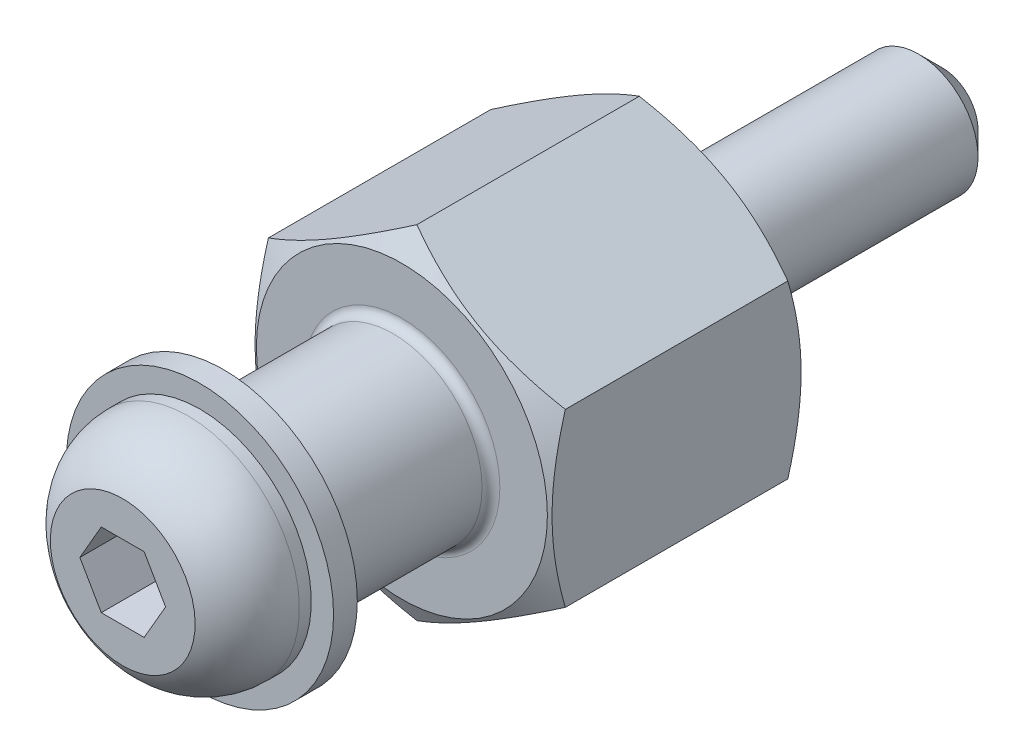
ISO-10303-21;
HEADER;
FILE_DESCRIPTION(('STEP AP214'),'2;1');
FILE_NAME('part.step','',(''),(''),'','','');
FILE_SCHEMA(('AUTOMOTIVE_DESIGN { 1 0 10303 214 1 1 1 1 }'));
ENDSEC;
DATA;
#1=APPLICATION_CONTEXT('core data for automotive mechanical design processes');
#2=APPLICATION_PROTOCOL_DEFINITION('international standard','automotive_design',2000,#1);
#3=PRODUCT_CONTEXT('',#1,'mechanical');
#4=PRODUCT('Part','Part','',(#3));
#5=PRODUCT_RELATED_PRODUCT_CATEGORY('part','',(#4));
#6=PRODUCT_DEFINITION_FORMATION('','',#4);
#7=PRODUCT_DEFINITION_CONTEXT('part definition',#1,'design');
#8=PRODUCT_DEFINITION('design','',#6,#7);
#9=PRODUCT_DEFINITION_SHAPE('','',#8);
#10=(LENGTH_UNIT() NAMED_UNIT(*) SI_UNIT(.MILLI.,.METRE.));
#11=(NAMED_UNIT(*) PLANE_ANGLE_UNIT() SI_UNIT($,.RADIAN.));
#12=(NAMED_UNIT(*) SI_UNIT($,.STERADIAN.) SOLID_ANGLE_UNIT());
#13=UNCERTAINTY_MEASURE_WITH_UNIT(LENGTH_MEASURE(1.E-05),#10,'distance_accuracy_value','');
#14=(GEOMETRIC_REPRESENTATION_CONTEXT(3) GLOBAL_UNCERTAINTY_ASSIGNED_CONTEXT((#13)) GLOBAL_UNIT_ASSIGNED_CONTEXT((#10,
#11,#12)) REPRESENTATION_CONTEXT('',''));
#15=CARTESIAN_POINT('',(0.,0.,0.));
#16=DIRECTION('',(0.,0.,1.));
#17=DIRECTION('',(1.,0.,0.));
#18=AXIS2_PLACEMENT_3D('',#15,#16,#17);
#19=CARTESIAN_POINT('',(0.,-6.07350269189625,14.));
#20=DIRECTION('',(-0.5,-0.866025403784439,0.));
#21=DIRECTION('',(-0.866025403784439,0.5,0.));
#22=AXIS2_PLACEMENT_3D('',#19,#20,#21);
#23=PLANE('',#22);
#24=DIRECTION('',(0.,0.,-1.));
#25=VECTOR('',#24,1.);
#26=CARTESIAN_POINT('',(-5.,-3.18675134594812,14.));
#27=LINE('',#26,#25);
#28=CARTESIAN_POINT('',(-5.,-3.18675134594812,7.99568298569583));
#29=VERTEX_POINT('',#28);
#30=CARTESIAN_POINT('',(-5.,-3.18675134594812,0.50431701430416));
#31=VERTEX_POINT('',#30);
#32=EDGE_CURVE('E126',#29,#31,#27,.T.);
#33=ORIENTED_EDGE('',*,*,#32,.T.);
#34=CARTESIAN_POINT('',(-5.0002,-3.18663587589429,0.504383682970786));
#35=CARTESIAN_POINT('',(-4.78046540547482,-3.31349970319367,0.431121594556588));
#36=CARTESIAN_POINT('',(-4.55885141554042,-3.44144859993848,0.364486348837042));
#37=CARTESIAN_POINT('',(-4.11178600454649,-3.6995619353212,0.248174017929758));
#38=CARTESIAN_POINT('',(-3.88632664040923,-3.82973095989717,0.198538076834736));
#39=CARTESIAN_POINT('',(-3.43816769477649,-4.08847564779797,0.121286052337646));
#40=CARTESIAN_POINT('',(-3.21553790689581,-4.21701101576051,0.093155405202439));
#41=CARTESIAN_POINT('',(-2.88081009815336,-4.41026620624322,0.0679299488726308));
#42=CARTESIAN_POINT('',(-2.76915780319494,-4.4747286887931,0.0623484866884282));
#43=CARTESIAN_POINT('',(-2.5457500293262,-4.60371322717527,0.0569372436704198));
#44=CARTESIAN_POINT('',(-2.43399455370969,-4.66823528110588,0.0571072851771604));
#45=CARTESIAN_POINT('',(-2.12781576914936,-4.84500768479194,0.0654886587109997));
#46=CARTESIAN_POINT('',(-1.93349391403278,-4.95719946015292,0.0795647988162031));
#47=CARTESIAN_POINT('',(-1.54613989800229,-5.1808384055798,0.124200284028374));
#48=CARTESIAN_POINT('',(-1.35310909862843,-5.2922847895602,0.154774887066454));
#49=CARTESIAN_POINT('',(-0.964974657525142,-5.51637431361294,0.231203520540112));
#50=CARTESIAN_POINT('',(-0.769920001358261,-5.62898917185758,0.277381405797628));
#51=CARTESIAN_POINT('',(-0.382719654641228,-5.85253939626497,0.382186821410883));
#52=CARTESIAN_POINT('',(-0.19056900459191,-5.96347762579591,0.440789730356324));
#53=CARTESIAN_POINT('',(0.000200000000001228,-6.07361816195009,0.504383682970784));
#54=B_SPLINE_CURVE_WITH_KNOTS('',3,(#34,#35,#36,#37,#38,#39,#40,#41,#42,#43,#44,#45,#46,#47,#48,
#49,#50,#51,#52,#53),.UNSPECIFIED.,.F.,.F.,(4,2,2,2,2,2,2,2,2,4),(0.,0.792555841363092,
1.58701660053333,2.36181537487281,2.74884076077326,3.13585419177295,3.8096236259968,
4.4840172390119,5.17336882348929,5.86136694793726),.UNSPECIFIED.);
#55=CARTESIAN_POINT('',(0.,-6.07350269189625,0.504317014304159));
#56=VERTEX_POINT('',#55);
#57=EDGE_CURVE('E29',#31,#56,#54,.T.);
#58=ORIENTED_EDGE('',*,*,#57,.T.);
#59=DIRECTION('',(0.,0.,-1.));
#60=VECTOR('',#59,1.);
#61=CARTESIAN_POINT('',(0.,-6.07350269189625,14.));
#62=LINE('',#61,#60);
#63=CARTESIAN_POINT('',(0.,-6.07350269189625,7.99568298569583));
#64=VERTEX_POINT('',#63);
#65=EDGE_CURVE('E131',#64,#56,#62,.T.);
#66=ORIENTED_EDGE('',*,*,#65,.F.);
#67=CARTESIAN_POINT('',(-5.0002,-3.18663587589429,7.99561631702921));
#68=CARTESIAN_POINT('',(-4.78046540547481,-3.31349970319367,8.0688784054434));
#69=CARTESIAN_POINT('',(-4.55885141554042,-3.44144859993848,8.13551365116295));
#70=CARTESIAN_POINT('',(-4.11178600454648,-3.6995619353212,8.25182598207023));
#71=CARTESIAN_POINT('',(-3.88632664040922,-3.82973095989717,8.30146192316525));
#72=CARTESIAN_POINT('',(-3.43816769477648,-4.08847564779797,8.37871394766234));
#73=CARTESIAN_POINT('',(-3.2155379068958,-4.21701101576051,8.40684459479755));
#74=CARTESIAN_POINT('',(-2.88081009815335,-4.41026620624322,8.43207005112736));
#75=CARTESIAN_POINT('',(-2.76915780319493,-4.4747286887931,8.43765151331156));
#76=CARTESIAN_POINT('',(-2.54575002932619,-4.60371322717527,8.44306275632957));
#77=CARTESIAN_POINT('',(-2.43399455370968,-4.66823528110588,8.44289271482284));
#78=CARTESIAN_POINT('',(-2.12781576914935,-4.84500768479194,8.43451134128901));
#79=CARTESIAN_POINT('',(-1.93349391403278,-4.95719946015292,8.42043520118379));
#80=CARTESIAN_POINT('',(-1.54613989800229,-5.18083840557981,8.37579971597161));
#81=CARTESIAN_POINT('',(-1.35310909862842,-5.2922847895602,8.34522511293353));
#82=CARTESIAN_POINT('',(-0.96497465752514,-5.51637431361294,8.26879647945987));
#83=CARTESIAN_POINT('',(-0.769920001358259,-5.62898917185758,8.22261859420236));
#84=CARTESIAN_POINT('',(-0.382719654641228,-5.85253939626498,8.1178131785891));
#85=CARTESIAN_POINT('',(-0.190569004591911,-5.96347762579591,8.05921026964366));
#86=CARTESIAN_POINT('',(0.00020000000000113,-6.07361816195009,7.9956163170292));
#87=B_SPLINE_CURVE_WITH_KNOTS('',3,(#67,#68,#69,#70,#71,#72,#73,#74,#75,#76,#77,#78,#79,#80,#81,
#82,#83,#84,#85,#86),.UNSPECIFIED.,.F.,.F.,(4,2,2,2,2,2,2,2,2,4),(0.,0.792555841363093,
1.58701660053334,2.36181537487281,2.74884076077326,3.13585419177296,3.8096236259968,
4.4840172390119,5.17336882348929,5.86136694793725),.UNSPECIFIED.);
#88=EDGE_CURVE('E203',#29,#64,#87,.T.);
#89=ORIENTED_EDGE('',*,*,#88,.F.);
#90=EDGE_LOOP('',(#33,#58,#66,#89));
#91=FACE_BOUND('',#90,.T.);
#92=ADVANCED_FACE('F14',(#91),#23,.T.);
#93=CARTESIAN_POINT('',(5.,-3.18675134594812,14.));
#94=DIRECTION('',(0.5,-0.866025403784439,0.));
#95=DIRECTION('',(-0.866025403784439,-0.5,0.));
#96=AXIS2_PLACEMENT_3D('',#93,#94,#95);
#97=PLANE('',#96);
#98=ORIENTED_EDGE('',*,*,#65,.T.);
#99=CARTESIAN_POINT('',(-0.00019999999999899,-6.07361816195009,0.504383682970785));
#100=CARTESIAN_POINT('',(0.219534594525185,-5.9467543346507,0.431121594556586));
#101=CARTESIAN_POINT('',(0.44114858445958,-5.81880543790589,0.364486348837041));
#102=CARTESIAN_POINT('',(0.888213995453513,-5.56069210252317,0.248174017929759));
#103=CARTESIAN_POINT('',(1.11367335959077,-5.43052307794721,0.198538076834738));
#104=CARTESIAN_POINT('',(1.56183230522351,-5.17177839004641,0.121286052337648));
#105=CARTESIAN_POINT('',(1.78446209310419,-5.04324302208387,0.0931554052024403));
#106=CARTESIAN_POINT('',(2.11918990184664,-4.84998783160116,0.0679299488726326));
#107=CARTESIAN_POINT('',(2.23084219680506,-4.78552534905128,0.0623484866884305));
#108=CARTESIAN_POINT('',(2.4542499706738,-4.65654081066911,0.0569372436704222));
#109=CARTESIAN_POINT('',(2.56600544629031,-4.5920187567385,0.0571072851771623));
#110=CARTESIAN_POINT('',(2.87218423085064,-4.41524635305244,0.0654886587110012));
#111=CARTESIAN_POINT('',(3.06650608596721,-4.30305457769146,0.0795647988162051));
#112=CARTESIAN_POINT('',(3.45386010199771,-4.07941563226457,0.124200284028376));
#113=CARTESIAN_POINT('',(3.64689090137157,-3.96796924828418,0.154774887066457));
#114=CARTESIAN_POINT('',(4.03502534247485,-3.74387972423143,0.231203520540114));
#115=CARTESIAN_POINT('',(4.23007999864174,-3.6312648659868,0.277381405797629));
#116=CARTESIAN_POINT('',(4.61728034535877,-3.4077146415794,0.382186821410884));
#117=CARTESIAN_POINT('',(4.80943099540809,-3.29677641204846,0.440789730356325));
#118=CARTESIAN_POINT('',(5.0002,-3.18663587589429,0.504383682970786));
#119=B_SPLINE_CURVE_WITH_KNOTS('',3,(#99,#100,#101,#102,#103,#104,#105,#106,#107,#108,#109,#110,
#111,#112,#113,#114,#115,#116,#117,#118),.UNSPECIFIED.,.F.,.F.,(4,2,2,2,2,2,2,2,2,4),(0.,
0.792555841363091,1.58701660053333,2.3618153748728,2.74884076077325,3.13585419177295,
3.80962362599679,4.48401723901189,5.17336882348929,5.86136694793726),.UNSPECIFIED.);
#120=CARTESIAN_POINT('',(5.,-3.18675134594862,0.504317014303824));
#121=VERTEX_POINT('',#120);
#122=EDGE_CURVE('E254',#56,#121,#119,.T.);
#123=ORIENTED_EDGE('',*,*,#122,.T.);
#124=DIRECTION('',(0.,0.,-1.));
#125=VECTOR('',#124,1.);
#126=CARTESIAN_POINT('',(5.,-3.18675134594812,14.));
#127=LINE('',#126,#125);
#128=CARTESIAN_POINT('',(5.,-3.18675134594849,7.99568298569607));
#129=VERTEX_POINT('',#128);
#130=EDGE_CURVE('E139',#129,#121,#127,.T.);
#131=ORIENTED_EDGE('',*,*,#130,.F.);
#132=CARTESIAN_POINT('',(-0.000199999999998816,-6.07361816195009,7.9956163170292));
#133=CARTESIAN_POINT('',(0.219534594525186,-5.9467543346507,8.0688784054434));
#134=CARTESIAN_POINT('',(0.441148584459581,-5.81880543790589,8.13551365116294));
#135=CARTESIAN_POINT('',(0.888213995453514,-5.56069210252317,8.25182598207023));
#136=CARTESIAN_POINT('',(1.11367335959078,-5.4305230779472,8.30146192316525));
#137=CARTESIAN_POINT('',(1.56183230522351,-5.1717783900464,8.37871394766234));
#138=CARTESIAN_POINT('',(1.78446209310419,-5.04324302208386,8.40684459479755));
#139=CARTESIAN_POINT('',(2.11918990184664,-4.84998783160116,8.43207005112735));
#140=CARTESIAN_POINT('',(2.23084219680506,-4.78552534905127,8.43765151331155));
#141=CARTESIAN_POINT('',(2.4542499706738,-4.6565408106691,8.44306275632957));
#142=CARTESIAN_POINT('',(2.56600544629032,-4.5920187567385,8.44289271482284));
#143=CARTESIAN_POINT('',(2.87218423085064,-4.41524635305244,8.43451134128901));
#144=CARTESIAN_POINT('',(3.06650608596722,-4.30305457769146,8.42043520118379));
#145=CARTESIAN_POINT('',(3.45386010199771,-4.07941563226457,8.3757997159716));
#146=CARTESIAN_POINT('',(3.64689090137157,-3.96796924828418,8.34522511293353));
#147=CARTESIAN_POINT('',(4.03502534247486,-3.74387972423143,8.26879647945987));
#148=CARTESIAN_POINT('',(4.23007999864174,-3.6312648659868,8.22261859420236));
#149=CARTESIAN_POINT('',(4.61728034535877,-3.4077146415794,8.1178131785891));
#150=CARTESIAN_POINT('',(4.80943099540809,-3.29677641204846,8.05921026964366));
#151=CARTESIAN_POINT('',(5.0002,-3.18663587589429,7.9956163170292));
#152=B_SPLINE_CURVE_WITH_KNOTS('',3,(#132,#133,#134,#135,#136,#137,#138,#139,#140,#141,#142,
#143,#144,#145,#146,#147,#148,#149,#150,#151),.UNSPECIFIED.,.F.,.F.,(4,2,2,2,2,2,2,2,2,4),(0.,
0.792555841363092,1.58701660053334,2.36181537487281,2.74884076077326,3.13585419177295,
3.80962362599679,4.48401723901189,5.17336882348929,5.86136694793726),.UNSPECIFIED.);
#153=EDGE_CURVE('E196',#64,#129,#152,.T.);
#154=ORIENTED_EDGE('',*,*,#153,.F.);
#155=EDGE_LOOP('',(#98,#123,#131,#154));
#156=FACE_BOUND('',#155,.T.);
#157=ADVANCED_FACE('F264',(#156),#97,.T.);
#158=CARTESIAN_POINT('',(5.,2.58675134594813,14.));
#159=DIRECTION('',(1.,0.,0.));
#160=DIRECTION('',(0.,-1.,0.));
#161=AXIS2_PLACEMENT_3D('',#158,#159,#160);
#162=PLANE('',#161);
#163=ORIENTED_EDGE('',*,*,#130,.T.);
#164=CARTESIAN_POINT('',(5.,-8.10026608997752,2.52025625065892));
#165=CARTESIAN_POINT('',(5.,-7.88149437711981,2.41394782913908));
#166=CARTESIAN_POINT('',(5.,-7.66222538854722,2.30864546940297));
#167=CARTESIAN_POINT('',(5.,-7.22242859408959,2.10061777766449));
#168=CARTESIAN_POINT('',(5.,-7.00190060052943,1.99789284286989));
#169=CARTESIAN_POINT('',(5.,-6.55820725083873,1.79507791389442));
#170=CARTESIAN_POINT('',(5.,-6.33503410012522,1.6950049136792));
#171=CARTESIAN_POINT('',(5.,-5.88692884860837,1.49889298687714));
#172=CARTESIAN_POINT('',(5.,-5.66199683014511,1.40285387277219));
#173=CARTESIAN_POINT('',(5.,-5.20257581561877,1.21279512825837));
#174=CARTESIAN_POINT('',(5.,-4.968015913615,1.11894597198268));
#175=CARTESIAN_POINT('',(5.,-4.49616892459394,0.938239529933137));
#176=CARTESIAN_POINT('',(5.,-4.25888153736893,0.851383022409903));
#177=CARTESIAN_POINT('',(5.,-3.78163157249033,0.68690828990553));
#178=CARTESIAN_POINT('',(5.,-3.54167536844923,0.609271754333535));
#179=CARTESIAN_POINT('',(5.,-3.05832088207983,0.465697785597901));
#180=CARTESIAN_POINT('',(5.,-2.81492369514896,0.399756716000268));
#181=CARTESIAN_POINT('',(5.,-2.32591231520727,0.283062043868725));
#182=CARTESIAN_POINT('',(5.,-2.08031858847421,0.232224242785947));
#183=CARTESIAN_POINT('',(5.,-1.58602881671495,0.14857541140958));
#184=CARTESIAN_POINT('',(5.,-1.33733308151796,0.115762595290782));
#185=CARTESIAN_POINT('',(5.,-0.84134892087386,0.0712090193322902));
#186=CARTESIAN_POINT('',(5.,-0.594085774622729,0.0591937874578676));
#187=CARTESIAN_POINT('',(5.,-0.0994225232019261,0.0565286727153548));
#188=CARTESIAN_POINT('',(5.,0.147977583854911,0.0658790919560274));
#189=CARTESIAN_POINT('',(5.,0.566630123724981,0.0991139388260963));
#190=CARTESIAN_POINT('',(5.,0.738324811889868,0.117758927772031));
#191=CARTESIAN_POINT('',(5.,1.08047991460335,0.164203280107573));
#192=CARTESIAN_POINT('',(5.,1.25094016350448,0.192003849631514));
#193=CARTESIAN_POINT('',(5.,1.76022987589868,0.287680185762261));
#194=CARTESIAN_POINT('',(5.,2.0967834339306,0.367813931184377));
#195=CARTESIAN_POINT('',(5.,2.60008361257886,0.507055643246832));
#196=CARTESIAN_POINT('',(5.,2.76943156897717,0.557298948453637));
#197=CARTESIAN_POINT('',(5.,3.10648304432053,0.663075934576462));
#198=CARTESIAN_POINT('',(5.,3.27418655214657,0.718609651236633));
#199=CARTESIAN_POINT('',(5.,3.60800087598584,0.834070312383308));
#200=CARTESIAN_POINT('',(5.,3.77411217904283,0.893995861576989));
#201=CARTESIAN_POINT('',(5.,4.1049536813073,1.01752802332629));
#202=CARTESIAN_POINT('',(5.,4.26968389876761,1.08113458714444));
#203=CARTESIAN_POINT('',(5.,4.66636438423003,1.23858765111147));
#204=CARTESIAN_POINT('',(5.,4.89769878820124,1.33398312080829));
#205=CARTESIAN_POINT('',(5.,5.35832855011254,1.52959069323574));
#206=CARTESIAN_POINT('',(5.,5.58762376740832,1.62980312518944));
#207=CARTESIAN_POINT('',(5.,6.04456306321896,1.8340499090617));
#208=CARTESIAN_POINT('',(5.,6.27220675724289,1.93808511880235));
#209=CARTESIAN_POINT('',(5.,6.72608192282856,2.14919658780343));
#210=CARTESIAN_POINT('',(5.,6.95231336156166,2.2562729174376));
#211=CARTESIAN_POINT('',(5.,7.62977437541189,2.58140165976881));
#212=CARTESIAN_POINT('',(5.,8.07924541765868,2.80311556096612));
#213=CARTESIAN_POINT('',(5.,8.97482796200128,3.25303560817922));
#214=CARTESIAN_POINT('',(5.,9.42093990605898,3.48124088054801));
#215=CARTESIAN_POINT('',(5.,10.2719406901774,3.9221288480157));
#216=CARTESIAN_POINT('',(5.,10.6770287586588,4.13442771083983));
#217=CARTESIAN_POINT('',(5.,11.4857081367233,4.56189080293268));
#218=CARTESIAN_POINT('',(5.,11.8892993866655,4.77705514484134));
#219=CARTESIAN_POINT('',(5.00000000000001,12.6942431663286,5.20898261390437));
#220=CARTESIAN_POINT('',(5.00000000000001,13.0955987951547,5.42573997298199));
#221=CARTESIAN_POINT('',(5.00000000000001,13.8973575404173,5.86095360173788));
#222=CARTESIAN_POINT('',(5.,14.2977607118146,6.07940977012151));
#223=CARTESIAN_POINT('',(5.,14.6978159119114,6.29849670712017));
#224=B_SPLINE_CURVE_WITH_KNOTS('',3,(#164,#165,#166,#167,#168,#169,#170,#171,#172,#173,#174,
#175,#176,#177,#178,#179,#180,#181,#182,#183,#184,#185,#186,#187,#188,#189,#190,#191,#192,#193,
#194,#195,#196,#197,#198,#199,#200,#201,#202,#203,#204,#205,#206,#207,#208,#209,#210,#211,#212,
#213,#214,#215,#216,#217,#218,#219,#220,#221,#222,#223),.UNSPECIFIED.,.F.,.F.,(4,2,2,2,2,2,2,2,
2,2,2,2,2,2,2,2,2,2,2,2,2,2,2,2,2,2,2,2,2,4),(0.,0.729709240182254,1.45953025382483,
2.19324736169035,2.92693032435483,3.68475844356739,4.44267078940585,5.19905183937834,
5.9551972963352,6.7070446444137,7.45881748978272,8.20059108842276,8.94237517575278,
9.46023704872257,9.97816717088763,11.0145817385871,11.5444679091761,12.0743576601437,
12.6040797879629,13.1337949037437,13.8844152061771,14.6350868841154,15.3859280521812,
16.1367866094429,17.6402335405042,19.1434790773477,20.515507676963,21.8875903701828,
23.2560268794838,24.6243824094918),.UNSPECIFIED.);
#225=CARTESIAN_POINT('',(5.,2.58675134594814,0.504317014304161));
#226=VERTEX_POINT('',#225);
#227=EDGE_CURVE('E248',#121,#226,#224,.T.);
#228=ORIENTED_EDGE('',*,*,#227,.T.);
#229=DIRECTION('',(0.,0.,-1.));
#230=VECTOR('',#229,1.);
#231=CARTESIAN_POINT('',(5.,2.58675134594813,14.));
#232=LINE('',#231,#230);
#233=CARTESIAN_POINT('',(5.,2.58675134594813,7.99568298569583));
#234=VERTEX_POINT('',#233);
#235=EDGE_CURVE('E142',#234,#226,#232,.T.);
#236=ORIENTED_EDGE('',*,*,#235,.F.);
#237=CARTESIAN_POINT('',(5.,-8.13178919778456,5.96441251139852));
#238=CARTESIAN_POINT('',(5.,-7.91262729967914,6.07103556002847));
#239=CARTESIAN_POINT('',(5.,-7.69297032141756,6.1766580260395));
#240=CARTESIAN_POINT('',(5.,-7.25240298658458,6.38534015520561));
#241=CARTESIAN_POINT('',(5.,-7.03149244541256,6.48839942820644));
#242=CARTESIAN_POINT('',(5.,-6.58705488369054,6.69189482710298));
#243=CARTESIAN_POINT('',(5.,-6.3635202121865,6.79231429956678));
#244=CARTESIAN_POINT('',(5.,-5.91469855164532,6.98914254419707));
#245=CARTESIAN_POINT('',(5.,-5.68941164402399,7.08555150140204));
#246=CARTESIAN_POINT('',(5.,-5.22940410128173,7.27633883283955));
#247=CARTESIAN_POINT('',(5.,-4.9946140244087,7.37055066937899));
#248=CARTESIAN_POINT('',(5.,-4.52231649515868,7.55203003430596));
#249=CARTESIAN_POINT('',(5.,-4.2848087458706,7.63929679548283));
#250=CARTESIAN_POINT('',(5.,-3.80711672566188,7.80465361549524));
#251=CARTESIAN_POINT('',(5.,-3.56693869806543,7.88276153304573));
#252=CARTESIAN_POINT('',(5.,-3.08313949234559,8.0273468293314));
#253=CARTESIAN_POINT('',(5.,-2.8395193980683,8.09382778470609));
#254=CARTESIAN_POINT('',(5.,-2.34994583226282,8.21169382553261));
#255=CARTESIAN_POINT('',(5.,-2.10401139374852,8.26315653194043));
#256=CARTESIAN_POINT('',(5.,-1.60900717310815,8.34808950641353));
#257=CARTESIAN_POINT('',(5.,-1.35993775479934,8.38156184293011));
#258=CARTESIAN_POINT('',(5.,-0.863183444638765,8.4274107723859));
#259=CARTESIAN_POINT('',(5.,-0.615524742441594,8.44006411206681));
#260=CARTESIAN_POINT('',(5.,-0.12000898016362,8.44393557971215));
#261=CARTESIAN_POINT('',(5.,0.127848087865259,8.43515280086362));
#262=CARTESIAN_POINT('',(5.,0.546182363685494,8.40286680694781));
#263=CARTESIAN_POINT('',(5.,0.717098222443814,8.3846988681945));
#264=CARTESIAN_POINT('',(5.,1.05772311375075,8.33925770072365));
#265=CARTESIAN_POINT('',(5.,1.22743199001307,8.31198331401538));
#266=CARTESIAN_POINT('',(5.,1.7344772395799,8.21793071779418));
#267=CARTESIAN_POINT('',(5.,2.06957535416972,8.13893682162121));
#268=CARTESIAN_POINT('',(5.,2.57110588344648,8.00131095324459));
#269=CARTESIAN_POINT('',(5.,2.74011480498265,7.95152947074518));
#270=CARTESIAN_POINT('',(5.,3.0764905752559,7.84664834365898));
#271=CARTESIAN_POINT('',(5.,3.24385740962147,7.79154865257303));
#272=CARTESIAN_POINT('',(5.,3.57700706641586,7.67692605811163));
#273=CARTESIAN_POINT('',(5.,3.74279028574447,7.61740429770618));
#274=CARTESIAN_POINT('',(5.,4.07296885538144,7.49465807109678));
#275=CARTESIAN_POINT('',(5.,4.23736426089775,7.43143375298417));
#276=CARTESIAN_POINT('',(5.,4.58406624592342,7.29431978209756));
#277=CARTESIAN_POINT('',(5.,4.76622095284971,7.22004717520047));
#278=CARTESIAN_POINT('',(5.,5.12920286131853,7.06831957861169));
#279=CARTESIAN_POINT('',(5.,5.31003001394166,6.9908644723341));
#280=CARTESIAN_POINT('',(5.,5.85084923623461,6.75455288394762));
#281=CARTESIAN_POINT('',(5.,6.20912569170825,6.59177163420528));
#282=CARTESIAN_POINT('',(5.,6.9224805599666,6.25883166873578));
#283=CARTESIAN_POINT('',(5.,7.27755679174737,6.08866832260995));
#284=CARTESIAN_POINT('',(5.,7.98510662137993,5.74309856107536));
#285=CARTESIAN_POINT('',(5.,8.33758042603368,5.56769256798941));
#286=CARTESIAN_POINT('',(5.,9.04135358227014,5.21260083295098));
#287=CARTESIAN_POINT('',(5.,9.39264851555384,5.03290636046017));
#288=CARTESIAN_POINT('',(5.,10.0937169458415,4.67056366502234));
#289=CARTESIAN_POINT('',(5.,10.4434904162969,4.48791539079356));
#290=CARTESIAN_POINT('',(5.,11.1417079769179,4.12040755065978));
#291=CARTESIAN_POINT('',(5.,11.4901525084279,3.93554882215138));
#292=CARTESIAN_POINT('',(5.,12.1860835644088,3.56403580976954));
#293=CARTESIAN_POINT('',(5.,12.5335700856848,3.37738151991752));
#294=CARTESIAN_POINT('',(5.,13.4784940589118,2.86730424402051));
#295=CARTESIAN_POINT('',(5.00000000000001,14.0751737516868,2.54247800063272));
#296=CARTESIAN_POINT('',(5.00000000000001,15.2669681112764,1.88982319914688));
#297=CARTESIAN_POINT('',(5.00000000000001,15.8620826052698,1.56199432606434));
#298=CARTESIAN_POINT('',(5.00000000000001,17.0486399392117,0.905541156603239));
#299=CARTESIAN_POINT('',(5.00000000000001,17.6400877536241,0.576925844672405));
#300=CARTESIAN_POINT('',(5.00000000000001,18.8219967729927,-0.0819112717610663));
#301=CARTESIAN_POINT('',(5.,19.4124580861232,-0.41213288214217));
#302=CARTESIAN_POINT('',(5.,20.0025966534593,-0.742926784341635));
#303=B_SPLINE_CURVE_WITH_KNOTS('',3,(#237,#238,#239,#240,#241,#242,#243,#244,#245,#246,#247,
#248,#249,#250,#251,#252,#253,#254,#255,#256,#257,#258,#259,#260,#261,#262,#263,#264,#265,#266,
#267,#268,#269,#270,#271,#272,#273,#274,#275,#276,#277,#278,#279,#280,#281,#282,#283,#284,#285,
#286,#287,#288,#289,#290,#291,#292,#293,#294,#295,#296,#297,#298,#299,#300,#301,#302),
.UNSPECIFIED.,.F.,.F.,(4,2,2,2,2,2,2,2,2,2,2,2,2,2,2,2,2,2,2,2,2,2,2,2,2,2,2,2,2,2,2,2,4),(0.,
0.731174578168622,1.46245977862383,2.19759238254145,2.93269103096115,3.69156604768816,
4.45052478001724,5.20797811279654,5.9651980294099,6.7184320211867,7.4715793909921,
8.21463182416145,8.95771569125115,9.47310391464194,9.98855770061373,11.0199355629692,
11.5484523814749,12.0769738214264,12.6053591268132,13.133723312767,13.7238307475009,
14.3139598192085,15.4943905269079,16.6755726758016,17.8566599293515,19.0404009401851,
20.2241625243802,21.4074890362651,22.5908194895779,24.6289051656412,26.6672071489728,
28.6970285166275,30.7266103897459),.UNSPECIFIED.);
#304=EDGE_CURVE('E188',#129,#234,#303,.T.);
#305=ORIENTED_EDGE('',*,*,#304,.F.);
#306=EDGE_LOOP('',(#163,#228,#236,#305));
#307=FACE_BOUND('',#306,.T.);
#308=ADVANCED_FACE('F267',(#307),#162,.T.);
#309=CARTESIAN_POINT('',(0.,5.47350269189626,14.));
#310=DIRECTION('',(0.5,0.866025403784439,0.));
#311=DIRECTION('',(0.866025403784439,-0.5,0.));
#312=AXIS2_PLACEMENT_3D('',#309,#310,#311);
#313=PLANE('',#312);
#314=ORIENTED_EDGE('',*,*,#235,.T.);
#315=CARTESIAN_POINT('',(5.0002,2.5866358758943,0.504383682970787));
#316=CARTESIAN_POINT('',(4.78046540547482,2.71349970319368,0.431121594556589));
#317=CARTESIAN_POINT('',(4.55885141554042,2.84144859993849,0.364486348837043));
#318=CARTESIAN_POINT('',(4.11178600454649,3.09956193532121,0.248174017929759));
#319=CARTESIAN_POINT('',(3.88632664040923,3.22973095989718,0.198538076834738));
#320=CARTESIAN_POINT('',(3.43816769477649,3.48847564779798,0.121286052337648));
#321=CARTESIAN_POINT('',(3.21553790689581,3.61701101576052,0.0931554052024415));
#322=CARTESIAN_POINT('',(2.88081009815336,3.81026620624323,0.0679299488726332));
#323=CARTESIAN_POINT('',(2.76915780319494,3.87472868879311,0.0623484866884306));
#324=CARTESIAN_POINT('',(2.5457500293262,4.00371322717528,0.056937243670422));
#325=CARTESIAN_POINT('',(2.43399455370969,4.06823528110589,0.0571072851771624));
#326=CARTESIAN_POINT('',(2.12781576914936,4.24500768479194,0.0654886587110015));
#327=CARTESIAN_POINT('',(1.93349391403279,4.35719946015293,0.0795647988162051));
#328=CARTESIAN_POINT('',(1.54613989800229,4.58083840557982,0.124200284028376));
#329=CARTESIAN_POINT('',(1.35310909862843,4.69228478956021,0.154774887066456));
#330=CARTESIAN_POINT('',(0.964974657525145,4.91637431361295,0.231203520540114));
#331=CARTESIAN_POINT('',(0.769920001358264,5.02898917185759,0.27738140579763));
#332=CARTESIAN_POINT('',(0.382719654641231,5.25253939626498,0.382186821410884));
#333=CARTESIAN_POINT('',(0.190569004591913,5.36347762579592,0.440789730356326));
#334=CARTESIAN_POINT('',(-0.000199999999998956,5.4736181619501,0.504383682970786));
#335=B_SPLINE_CURVE_WITH_KNOTS('',3,(#315,#316,#317,#318,#319,#320,#321,#322,#323,#324,#325,
#326,#327,#328,#329,#330,#331,#332,#333,#334),.UNSPECIFIED.,.F.,.F.,(4,2,2,2,2,2,2,2,2,4),(0.,
0.792555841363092,1.58701660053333,2.3618153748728,2.74884076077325,3.13585419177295,
3.80962362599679,4.48401723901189,5.17336882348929,5.86136694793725),.UNSPECIFIED.);
#336=CARTESIAN_POINT('',(0.,5.47350269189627,0.504317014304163));
#337=VERTEX_POINT('',#336);
#338=EDGE_CURVE('E120',#226,#337,#335,.T.);
#339=ORIENTED_EDGE('',*,*,#338,.T.);
#340=DIRECTION('',(0.,0.,-1.));
#341=VECTOR('',#340,1.);
#342=CARTESIAN_POINT('',(0.,5.47350269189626,14.));
#343=LINE('',#342,#341);
#344=CARTESIAN_POINT('',(0.,5.47350269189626,7.99568298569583));
#345=VERTEX_POINT('',#344);
#346=EDGE_CURVE('E119',#345,#337,#343,.T.);
#347=ORIENTED_EDGE('',*,*,#346,.F.);
#348=CARTESIAN_POINT('',(5.0002,2.5866358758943,7.9956163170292));
#349=CARTESIAN_POINT('',(4.78046540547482,2.71349970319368,8.0688784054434));
#350=CARTESIAN_POINT('',(4.55885141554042,2.84144859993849,8.13551365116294));
#351=CARTESIAN_POINT('',(4.11178600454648,3.09956193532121,8.25182598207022));
#352=CARTESIAN_POINT('',(3.88632664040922,3.22973095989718,8.30146192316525));
#353=CARTESIAN_POINT('',(3.43816769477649,3.48847564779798,8.37871394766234));
#354=CARTESIAN_POINT('',(3.2155379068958,3.61701101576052,8.40684459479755));
#355=CARTESIAN_POINT('',(2.88081009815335,3.81026620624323,8.43207005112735));
#356=CARTESIAN_POINT('',(2.76915780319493,3.87472868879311,8.43765151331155));
#357=CARTESIAN_POINT('',(2.5457500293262,4.00371322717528,8.44306275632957));
#358=CARTESIAN_POINT('',(2.43399455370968,4.06823528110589,8.44289271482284));
#359=CARTESIAN_POINT('',(2.12781576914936,4.24500768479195,8.43451134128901));
#360=CARTESIAN_POINT('',(1.93349391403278,4.35719946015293,8.42043520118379));
#361=CARTESIAN_POINT('',(1.54613989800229,4.58083840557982,8.3757997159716));
#362=CARTESIAN_POINT('',(1.35310909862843,4.6922847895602,8.34522511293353));
#363=CARTESIAN_POINT('',(0.964974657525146,4.91637431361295,8.26879647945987));
#364=CARTESIAN_POINT('',(0.769920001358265,5.02898917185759,8.22261859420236));
#365=CARTESIAN_POINT('',(0.382719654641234,5.25253939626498,8.1178131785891));
#366=CARTESIAN_POINT('',(0.190569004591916,5.36347762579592,8.05921026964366));
#367=CARTESIAN_POINT('',(-0.000199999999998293,5.47361816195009,7.9956163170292));
#368=B_SPLINE_CURVE_WITH_KNOTS('',3,(#348,#349,#350,#351,#352,#353,#354,#355,#356,#357,#358,
#359,#360,#361,#362,#363,#364,#365,#366,#367),.UNSPECIFIED.,.F.,.F.,(4,2,2,2,2,2,2,2,2,4),(0.,
0.792555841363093,1.58701660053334,2.36181537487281,2.74884076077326,3.13585419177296,
3.80962362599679,4.48401723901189,5.17336882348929,5.86136694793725),.UNSPECIFIED.);
#369=EDGE_CURVE('E155',#234,#345,#368,.T.);
#370=ORIENTED_EDGE('',*,*,#369,.F.);
#371=EDGE_LOOP('',(#314,#339,#347,#370));
#372=FACE_BOUND('',#371,.T.);
#373=ADVANCED_FACE('F165',(#372),#313,.T.);
#374=CARTESIAN_POINT('',(-5.,2.58675134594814,14.));
#375=DIRECTION('',(-0.5,0.866025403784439,0.));
#376=DIRECTION('',(0.866025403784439,0.5,0.));
#377=AXIS2_PLACEMENT_3D('',#374,#375,#376);
#378=PLANE('',#377);
#379=ORIENTED_EDGE('',*,*,#346,.T.);
#380=CARTESIAN_POINT('',(0.000200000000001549,5.47361816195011,0.504383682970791));
#381=CARTESIAN_POINT('',(-0.219534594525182,5.34675433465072,0.431121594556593));
#382=CARTESIAN_POINT('',(-0.441148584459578,5.21880543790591,0.364486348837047));
#383=CARTESIAN_POINT('',(-0.888213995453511,4.96069210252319,0.248174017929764));
#384=CARTESIAN_POINT('',(-1.11367335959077,4.83052307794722,0.198538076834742));
#385=CARTESIAN_POINT('',(-1.56183230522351,4.57177839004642,0.121286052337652));
#386=CARTESIAN_POINT('',(-1.78446209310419,4.44324302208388,0.0931554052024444));
#387=CARTESIAN_POINT('',(-2.11918990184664,4.24998783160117,0.0679299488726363));
#388=CARTESIAN_POINT('',(-2.23084219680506,4.18552534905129,0.0623484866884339));
#389=CARTESIAN_POINT('',(-2.4542499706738,4.05654081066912,0.0569372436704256));
#390=CARTESIAN_POINT('',(-2.56600544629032,3.99201875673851,0.0571072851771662));
#391=CARTESIAN_POINT('',(-2.87218423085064,3.81524635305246,0.0654886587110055));
#392=CARTESIAN_POINT('',(-3.06650608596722,3.70305457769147,0.0795647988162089));
#393=CARTESIAN_POINT('',(-3.45386010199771,3.47941563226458,0.12420028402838));
#394=CARTESIAN_POINT('',(-3.64689090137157,3.36796924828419,0.15477488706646));
#395=CARTESIAN_POINT('',(-4.03502534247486,3.14387972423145,0.231203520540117));
#396=CARTESIAN_POINT('',(-4.23007999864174,3.03126486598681,0.277381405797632));
#397=CARTESIAN_POINT('',(-4.61728034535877,2.80771464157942,0.382186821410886));
#398=CARTESIAN_POINT('',(-4.80943099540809,2.69677641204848,0.440789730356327));
#399=CARTESIAN_POINT('',(-5.0002,2.5866358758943,0.504383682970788));
#400=B_SPLINE_CURVE_WITH_KNOTS('',3,(#380,#381,#382,#383,#384,#385,#386,#387,#388,#389,#390,
#391,#392,#393,#394,#395,#396,#397,#398,#399),.UNSPECIFIED.,.F.,.F.,(4,2,2,2,2,2,2,2,2,4),(0.,
0.792555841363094,1.58701660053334,2.36181537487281,2.74884076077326,3.13585419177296,
3.8096236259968,4.4840172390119,5.17336882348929,5.86136694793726),.UNSPECIFIED.);
#401=CARTESIAN_POINT('',(-5.,2.58675134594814,0.504317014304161));
#402=VERTEX_POINT('',#401);
#403=EDGE_CURVE('E104',#337,#402,#400,.T.);
#404=ORIENTED_EDGE('',*,*,#403,.T.);
#405=DIRECTION('',(0.,0.,-1.));
#406=VECTOR('',#405,1.);
#407=CARTESIAN_POINT('',(-5.,2.58675134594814,14.));
#408=LINE('',#407,#406);
#409=CARTESIAN_POINT('',(-5.,2.58675134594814,7.99568298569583));
#410=VERTEX_POINT('',#409);
#411=EDGE_CURVE('E117',#410,#402,#408,.T.);
#412=ORIENTED_EDGE('',*,*,#411,.F.);
#413=CARTESIAN_POINT('',(0.000200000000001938,5.47361816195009,7.9956163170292));
#414=CARTESIAN_POINT('',(-0.219534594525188,5.34675433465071,8.0688784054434));
#415=CARTESIAN_POINT('',(-0.441148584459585,5.2188054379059,8.13551365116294));
#416=CARTESIAN_POINT('',(-0.88821399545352,4.96069210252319,8.25182598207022));
#417=CARTESIAN_POINT('',(-1.11367335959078,4.83052307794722,8.30146192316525));
#418=CARTESIAN_POINT('',(-1.56183230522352,4.57177839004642,8.37871394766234));
#419=CARTESIAN_POINT('',(-1.7844620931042,4.44324302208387,8.40684459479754));
#420=CARTESIAN_POINT('',(-2.11918990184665,4.24998783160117,8.43207005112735));
#421=CARTESIAN_POINT('',(-2.23084219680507,4.18552534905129,8.43765151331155));
#422=CARTESIAN_POINT('',(-2.4542499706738,4.05654081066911,8.44306275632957));
#423=CARTESIAN_POINT('',(-2.56600544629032,3.9920187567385,8.44289271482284));
#424=CARTESIAN_POINT('',(-2.87218423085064,3.81524635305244,8.43451134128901));
#425=CARTESIAN_POINT('',(-3.06650608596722,3.70305457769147,8.42043520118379));
#426=CARTESIAN_POINT('',(-3.45386010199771,3.47941563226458,8.3757997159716));
#427=CARTESIAN_POINT('',(-3.64689090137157,3.36796924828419,8.34522511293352));
#428=CARTESIAN_POINT('',(-4.03502534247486,3.14387972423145,8.26879647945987));
#429=CARTESIAN_POINT('',(-4.23007999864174,3.03126486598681,8.22261859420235));
#430=CARTESIAN_POINT('',(-4.61728034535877,2.80771464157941,8.1178131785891));
#431=CARTESIAN_POINT('',(-4.80943099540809,2.69677641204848,8.05921026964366));
#432=CARTESIAN_POINT('',(-5.0002,2.5866358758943,7.9956163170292));
#433=B_SPLINE_CURVE_WITH_KNOTS('',3,(#413,#414,#415,#416,#417,#418,#419,#420,#421,#422,#423,
#424,#425,#426,#427,#428,#429,#430,#431,#432),.UNSPECIFIED.,.F.,.F.,(4,2,2,2,2,2,2,2,2,4),(0.,
0.792555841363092,1.58701660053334,2.36181537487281,2.74884076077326,3.13585419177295,
3.80962362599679,4.48401723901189,5.17336882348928,5.86136694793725),.UNSPECIFIED.);
#434=EDGE_CURVE('E145',#345,#410,#433,.T.);
#435=ORIENTED_EDGE('',*,*,#434,.F.);
#436=EDGE_LOOP('',(#379,#404,#412,#435));
#437=FACE_BOUND('',#436,.T.);
#438=ADVANCED_FACE('F115',(#437),#378,.T.);
#439=CARTESIAN_POINT('',(-5.,-3.18675134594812,14.));
#440=DIRECTION('',(-1.,0.,0.));
#441=DIRECTION('',(0.,1.,0.));
#442=AXIS2_PLACEMENT_3D('',#439,#440,#441);
#443=PLANE('',#442);
#444=ORIENTED_EDGE('',*,*,#411,.T.);
#445=CARTESIAN_POINT('',(-5.,-8.10026609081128,2.52025625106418));
#446=CARTESIAN_POINT('',(-5.,-7.88149437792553,2.41394782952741));
#447=CARTESIAN_POINT('',(-5.,-7.66222538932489,2.30864546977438));
#448=CARTESIAN_POINT('',(-5.,-7.22242859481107,2.10061777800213));
#449=CARTESIAN_POINT('',(-5.,-7.00190060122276,1.99789284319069));
#450=CARTESIAN_POINT('',(-5.,-6.55820725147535,1.79507791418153));
#451=CARTESIAN_POINT('',(-5.,-6.33503410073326,1.69500491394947));
#452=CARTESIAN_POINT('',(-5.,-5.88692884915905,1.49889298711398));
#453=CARTESIAN_POINT('',(-5.,-5.66199683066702,1.40285387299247));
#454=CARTESIAN_POINT('',(-5.,-5.20257581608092,1.21279512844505));
#455=CARTESIAN_POINT('',(-5.,-4.96801591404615,1.11894597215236));
#456=CARTESIAN_POINT('',(-5.,-4.49616892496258,0.938239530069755));
#457=CARTESIAN_POINT('',(-5.,-4.25888153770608,0.851383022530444));
#458=CARTESIAN_POINT('',(-5.,-3.78163157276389,0.686908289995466));
#459=CARTESIAN_POINT('',(-5.,-3.5416753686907,0.60927175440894));
#460=CARTESIAN_POINT('',(-5.,-3.05832088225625,0.465697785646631));
#461=CARTESIAN_POINT('',(-5.,-2.81492369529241,0.399756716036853));
#462=CARTESIAN_POINT('',(-5.,-2.32591231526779,0.283062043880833));
#463=CARTESIAN_POINT('',(-5.,-2.08031858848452,0.232224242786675));
#464=CARTESIAN_POINT('',(-5.,-1.58602881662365,0.148575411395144));
#465=CARTESIAN_POINT('',(-5.,-1.33733308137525,0.115762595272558));
#466=CARTESIAN_POINT('',(-5.,-0.841348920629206,0.0712090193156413));
#467=CARTESIAN_POINT('',(-5.,-0.594085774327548,0.0591937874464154));
#468=CARTESIAN_POINT('',(-5.,-0.0994225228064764,0.0565286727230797));
#469=CARTESIAN_POINT('',(-5.,0.1479775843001,0.0658790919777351));
#470=CARTESIAN_POINT('',(-5.,0.566630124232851,0.0991139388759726));
#471=CARTESIAN_POINT('',(-5.,0.738324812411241,0.117758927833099));
#472=CARTESIAN_POINT('',(-5.,1.08047991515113,0.164203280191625));
#473=CARTESIAN_POINT('',(-5.,1.25094016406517,0.192003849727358));
#474=CARTESIAN_POINT('',(-5.,1.76022987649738,0.287680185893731));
#475=CARTESIAN_POINT('',(-5.,2.09678343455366,0.367813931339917));
#476=CARTESIAN_POINT('',(-5.,2.60008361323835,0.507055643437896));
#477=CARTESIAN_POINT('',(-5.,2.76943156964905,0.55729894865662));
#478=CARTESIAN_POINT('',(-5.,3.10648304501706,0.663075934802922));
#479=CARTESIAN_POINT('',(-5.,3.27418655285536,0.718609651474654));
#480=CARTESIAN_POINT('',(-5.,3.60800087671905,0.834070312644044));
#481=CARTESIAN_POINT('',(-5.,3.77411217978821,0.893995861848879));
#482=CARTESIAN_POINT('',(-5.,4.10495368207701,1.01752802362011));
#483=CARTESIAN_POINT('',(-5.,4.26968389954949,1.08113458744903));
#484=CARTESIAN_POINT('',(-5.,4.66636438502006,1.23858765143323));
#485=CARTESIAN_POINT('',(-5.,4.89769878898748,1.33398312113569));
#486=CARTESIAN_POINT('',(-5.,5.35832855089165,1.52959069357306));
#487=CARTESIAN_POINT('',(-5.,5.58762376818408,1.62980312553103));
#488=CARTESIAN_POINT('',(-5.,6.04456306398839,1.83404990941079));
#489=CARTESIAN_POINT('',(-5.,6.27220675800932,1.93808511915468));
#490=CARTESIAN_POINT('',(-5.,6.72608192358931,2.14919658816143));
#491=CARTESIAN_POINT('',(-5.,6.95231336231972,2.25627291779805));
#492=CARTESIAN_POINT('',(-5.,7.629774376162,2.58140166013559));
#493=CARTESIAN_POINT('',(-5.,8.07924541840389,2.8031155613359));
#494=CARTESIAN_POINT('',(-5.,8.97482796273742,3.25303560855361));
#495=CARTESIAN_POINT('',(-5.,9.42093990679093,3.481240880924));
#496=CARTESIAN_POINT('',(-5.,10.2719406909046,3.9221288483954));
#497=CARTESIAN_POINT('',(-5.,10.6770287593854,4.13442771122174));
#498=CARTESIAN_POINT('',(-5.,11.4857081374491,4.56189080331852));
#499=CARTESIAN_POINT('',(-5.,11.889299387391,4.77705514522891));
#500=CARTESIAN_POINT('',(-5.,12.694243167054,5.20898261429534));
#501=CARTESIAN_POINT('',(-4.99999999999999,13.0955987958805,5.42573997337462));
#502=CARTESIAN_POINT('',(-4.99999999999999,13.8973575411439,5.86095360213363));
#503=CARTESIAN_POINT('',(-5.,14.2977607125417,6.07940977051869));
#504=CARTESIAN_POINT('',(-5.,14.697815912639,6.29849670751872));
#505=B_SPLINE_CURVE_WITH_KNOTS('',3,(#445,#446,#447,#448,#449,#450,#451,#452,#453,#454,#455,
#456,#457,#458,#459,#460,#461,#462,#463,#464,#465,#466,#467,#468,#469,#470,#471,#472,#473,#474,
#475,#476,#477,#478,#479,#480,#481,#482,#483,#484,#485,#486,#487,#488,#489,#490,#491,#492,#493,
#494,#495,#496,#497,#498,#499,#500,#501,#502,#503,#504),.UNSPECIFIED.,.F.,.F.,(4,2,2,2,2,2,2,2,
2,2,2,2,2,2,2,2,2,2,2,2,2,2,2,2,2,2,2,2,2,4),(0.,0.729709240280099,1.45953025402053,
2.19324736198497,2.92693032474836,3.68475844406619,4.44267079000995,5.19905184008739,
5.95519729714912,6.70704464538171,7.45881749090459,8.20059108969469,8.94237517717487,
9.46023705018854,9.97816717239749,11.0145817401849,11.5444679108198,12.0743576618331,
12.604079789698,13.1337949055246,13.884415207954,14.6350868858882,15.3859280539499,
16.1367866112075,17.6402335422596,19.1434790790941,20.5155076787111,21.8875903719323,
23.2560268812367,24.624382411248),.UNSPECIFIED.);
#506=EDGE_CURVE('E100',#402,#31,#505,.F.);
#507=ORIENTED_EDGE('',*,*,#506,.T.);
#508=ORIENTED_EDGE('',*,*,#32,.F.);
#509=CARTESIAN_POINT('',(-5.,-8.13178919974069,5.9644125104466));
#510=CARTESIAN_POINT('',(-5.,-7.91262730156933,6.07103555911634));
#511=CARTESIAN_POINT('',(-5.,-7.69297032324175,6.17665802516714));
#512=CARTESIAN_POINT('',(-5.,-7.2524029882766,6.38534015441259));
#513=CARTESIAN_POINT('',(-5.,-7.03149244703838,6.48839942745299));
#514=CARTESIAN_POINT('',(-5.,-6.58705488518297,6.69189482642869));
#515=CARTESIAN_POINT('',(-5.,-6.36352021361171,6.79231429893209));
#516=CARTESIAN_POINT('',(-5.,-5.91469855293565,6.98914254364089));
#517=CARTESIAN_POINT('',(-5.,-5.68941164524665,7.08555150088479));
#518=CARTESIAN_POINT('',(-5.,-5.22940410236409,7.27633883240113));
#519=CARTESIAN_POINT('',(-5.,-4.99461402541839,7.37055066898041));
#520=CARTESIAN_POINT('',(-5.,-4.52231649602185,7.5520300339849));
#521=CARTESIAN_POINT('',(-5.,-4.28480874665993,7.63929679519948));
#522=CARTESIAN_POINT('',(-5.,-3.80711672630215,7.80465361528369));
#523=CARTESIAN_POINT('',(-5.,-3.56693869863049,7.8827615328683));
#524=CARTESIAN_POINT('',(-5.,-3.0831394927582,8.02734682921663));
#525=CARTESIAN_POINT('',(-5.,-2.83951939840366,8.09382778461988));
#526=CARTESIAN_POINT('',(-5.,-2.34994583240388,8.21169382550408));
#527=CARTESIAN_POINT('',(-5.,-2.10401139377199,8.2631565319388));
#528=CARTESIAN_POINT('',(-5.,-1.6090071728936,8.34808950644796));
#529=CARTESIAN_POINT('',(-5.,-1.35993775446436,8.38156184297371));
#530=CARTESIAN_POINT('',(-5.,-0.863183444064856,8.42741077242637));
#531=CARTESIAN_POINT('',(-5.,-0.615524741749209,8.44006411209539));
#532=CARTESIAN_POINT('',(-5.,-0.120008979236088,8.44393557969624));
#533=CARTESIAN_POINT('',(-5.,0.12784808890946,8.43515280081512));
#534=CARTESIAN_POINT('',(-5.,0.546182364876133,8.40286680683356));
#535=CARTESIAN_POINT('',(-5.,0.717098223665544,8.38469886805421));
#536=CARTESIAN_POINT('',(-5.,1.05772311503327,8.33925770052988));
#537=CARTESIAN_POINT('',(-5.,1.22743199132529,8.31198331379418));
#538=CARTESIAN_POINT('',(-5.,1.73447724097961,8.2179307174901));
#539=CARTESIAN_POINT('',(-5.,2.06957535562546,8.13893682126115));
#540=CARTESIAN_POINT('',(-5.,2.57110588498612,8.00131095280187));
#541=CARTESIAN_POINT('',(-5.,2.7401148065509,7.95152947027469));
#542=CARTESIAN_POINT('',(-5.,3.07649057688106,7.84664834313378));
#543=CARTESIAN_POINT('',(-5.,3.24385741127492,7.7915486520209));
#544=CARTESIAN_POINT('',(-5.,3.57700706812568,7.6769260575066));
#545=CARTESIAN_POINT('',(-5.,3.74279028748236,7.61740429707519));
#546=CARTESIAN_POINT('',(-5.,4.07296885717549,7.49465807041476));
#547=CARTESIAN_POINT('',(-5.,4.23736426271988,7.43143375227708));
#548=CARTESIAN_POINT('',(-5.,4.58406624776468,7.29431978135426));
#549=CARTESIAN_POINT('',(-5.,4.76622095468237,7.22004717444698));
#550=CARTESIAN_POINT('',(-5.,5.12920286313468,7.06831957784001));
#551=CARTESIAN_POINT('',(-5.,5.31003001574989,6.99086447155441));
#552=CARTESIAN_POINT('',(-5.,5.85084923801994,6.75455288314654));
#553=CARTESIAN_POINT('',(-5.,6.20912569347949,6.5917716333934));
#554=CARTESIAN_POINT('',(-5.,6.92248056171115,6.25883166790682));
#555=CARTESIAN_POINT('',(-5.,7.27755679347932,6.08866832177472));
#556=CARTESIAN_POINT('',(-5.,7.98510662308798,5.74309856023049));
#557=CARTESIAN_POINT('',(-5.,8.33758042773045,5.56769256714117));
#558=CARTESIAN_POINT('',(-5.,9.04135358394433,5.21260083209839));
#559=CARTESIAN_POINT('',(-5.,9.39264851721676,5.03290635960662));
#560=CARTESIAN_POINT('',(-5.,10.0937169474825,4.67056366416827));
#561=CARTESIAN_POINT('',(-5.,10.4434904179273,4.48791538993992));
#562=CARTESIAN_POINT('',(-5.,11.1417079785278,4.12040754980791));
#563=CARTESIAN_POINT('',(-5.,11.4901525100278,3.93554882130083));
#564=CARTESIAN_POINT('',(-5.,12.1860835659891,3.56403580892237));
#565=CARTESIAN_POINT('',(-4.99999999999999,12.5335700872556,3.3773815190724));
#566=CARTESIAN_POINT('',(-4.99999999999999,13.4784940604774,2.86730424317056));
#567=CARTESIAN_POINT('',(-4.99999999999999,14.075173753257,2.54247799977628));
#568=CARTESIAN_POINT('',(-4.99999999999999,15.2669681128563,1.8898231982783));
#569=CARTESIAN_POINT('',(-4.99999999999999,15.8620826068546,1.56199432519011));
#570=CARTESIAN_POINT('',(-4.99999999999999,17.0486399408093,0.905541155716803));
#571=CARTESIAN_POINT('',(-4.99999999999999,17.6400877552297,0.576925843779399));
#572=CARTESIAN_POINT('',(-4.99999999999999,18.8219967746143,-0.081911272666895));
#573=CARTESIAN_POINT('',(-5.,19.4124580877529,-0.412132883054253));
#574=CARTESIAN_POINT('',(-5.,20.0025966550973,-0.742926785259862));
#575=B_SPLINE_CURVE_WITH_KNOTS('',3,(#509,#510,#511,#512,#513,#514,#515,#516,#517,#518,#519,
#520,#521,#522,#523,#524,#525,#526,#527,#528,#529,#530,#531,#532,#533,#534,#535,#536,#537,#538,
#539,#540,#541,#542,#543,#544,#545,#546,#547,#548,#549,#550,#551,#552,#553,#554,#555,#556,#557,
#558,#559,#560,#561,#562,#563,#564,#565,#566,#567,#568,#569,#570,#571,#572,#573,#574),
.UNSPECIFIED.,.F.,.F.,(4,2,2,2,2,2,2,2,2,2,2,2,2,2,2,2,2,2,2,2,2,2,2,2,2,2,2,2,2,2,2,2,4),(0.,
0.73117457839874,1.4624597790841,2.19759238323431,2.93269103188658,3.69156604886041,
4.45052478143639,5.20797811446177,5.96519803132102,6.71843202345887,7.47157939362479,
8.21463182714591,8.95771569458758,9.47310391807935,9.98855770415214,11.0199355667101,
11.5484523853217,12.0769738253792,12.6053591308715,13.133723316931,13.7238307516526,
14.3139598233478,15.4943905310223,16.6755726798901,17.8566599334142,19.0404009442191,
20.2241625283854,21.407489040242,22.5908194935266,24.6289051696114,26.6672071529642,
28.6970285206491,30.726610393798),.UNSPECIFIED.);
#576=EDGE_CURVE('E124',#410,#29,#575,.F.);
#577=ORIENTED_EDGE('',*,*,#576,.F.);
#578=EDGE_LOOP('',(#444,#507,#508,#577));
#579=FACE_BOUND('',#578,.T.);
#580=ADVANCED_FACE('F123',(#579),#443,.T.);
#581=CARTESIAN_POINT('',(2.1650635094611,1.25,15.9));
#582=DIRECTION('',(0.,0.,1.));
#583=DIRECTION('',(0.,-1.,0.));
#584=AXIS2_PLACEMENT_3D('',#581,#582,#583);
#585=PLANE('',#584);
#586=DIRECTION('',(0.5,0.866025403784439,0.));
#587=VECTOR('',#586,1.);
#588=CARTESIAN_POINT('',(0.721687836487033,-1.25,15.9));
#589=LINE('',#588,#587);
#590=CARTESIAN_POINT('',(0.721687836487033,-1.25,15.9));
#591=VERTEX_POINT('',#590);
#592=CARTESIAN_POINT('',(1.44337567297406,0.,15.9));
#593=VERTEX_POINT('',#592);
#594=EDGE_CURVE('E652',#591,#593,#589,.T.);
#595=ORIENTED_EDGE('',*,*,#594,.T.);
#596=DIRECTION('',(-0.5,0.866025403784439,0.));
#597=VECTOR('',#596,1.);
#598=CARTESIAN_POINT('',(1.44337567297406,0.,15.9));
#599=LINE('',#598,#597);
#600=CARTESIAN_POINT('',(0.721687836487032,1.25,15.9));
#601=VERTEX_POINT('',#600);
#602=EDGE_CURVE('E649',#593,#601,#599,.T.);
#603=ORIENTED_EDGE('',*,*,#602,.T.);
#604=DIRECTION('',(-1.,0.,0.));
#605=VECTOR('',#604,1.);
#606=CARTESIAN_POINT('',(0.721687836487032,1.25,15.9));
#607=LINE('',#606,#605);
#608=CARTESIAN_POINT('',(-0.721687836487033,1.25,15.9));
#609=VERTEX_POINT('',#608);
#610=EDGE_CURVE('E646',#601,#609,#607,.T.);
#611=ORIENTED_EDGE('',*,*,#610,.T.);
#612=DIRECTION('',(-0.5,-0.866025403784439,0.));
#613=VECTOR('',#612,1.);
#614=CARTESIAN_POINT('',(-0.721687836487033,1.25,15.9));
#615=LINE('',#614,#613);
#616=CARTESIAN_POINT('',(-1.44337567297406,0.,15.9));
#617=VERTEX_POINT('',#616);
#618=EDGE_CURVE('E643',#609,#617,#615,.T.);
#619=ORIENTED_EDGE('',*,*,#618,.T.);
#620=DIRECTION('',(0.5,-0.866025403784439,0.));
#621=VECTOR('',#620,1.);
#622=CARTESIAN_POINT('',(-1.44337567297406,0.,15.9));
#623=LINE('',#622,#621);
#624=CARTESIAN_POINT('',(-0.721687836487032,-1.25,15.9));
#625=VERTEX_POINT('',#624);
#626=EDGE_CURVE('E640',#617,#625,#623,.T.);
#627=ORIENTED_EDGE('',*,*,#626,.T.);
#628=DIRECTION('',(1.,0.,0.));
#629=VECTOR('',#628,1.);
#630=CARTESIAN_POINT('',(-0.721687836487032,-1.25,15.9));
#631=LINE('',#630,#629);
#632=EDGE_CURVE('E631',#625,#591,#631,.T.);
#633=ORIENTED_EDGE('',*,*,#632,.T.);
#634=EDGE_LOOP('',(#595,#603,#611,#619,#627,#633));
#635=FACE_BOUND('',#634,.T.);
#636=ADVANCED_FACE('F345',(#635),#585,.T.);
#637=CARTESIAN_POINT('',(0.721687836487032,1.25,15.9));
#638=DIRECTION('',(0.,1.,0.));
#639=DIRECTION('',(0.,0.,1.));
#640=AXIS2_PLACEMENT_3D('',#637,#638,#639);
#641=PLANE('',#640);
#642=DIRECTION('',(-1.,0.,0.));
#643=VECTOR('',#642,1.);
#644=CARTESIAN_POINT('',(0.721687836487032,1.25,17.9));
#645=LINE('',#644,#643);
#646=CARTESIAN_POINT('',(0.721687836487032,1.25,17.9));
#647=VERTEX_POINT('',#646);
#648=CARTESIAN_POINT('',(-0.721687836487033,1.25,17.9));
#649=VERTEX_POINT('',#648);
#650=EDGE_CURVE('E664',#647,#649,#645,.T.);
#651=ORIENTED_EDGE('',*,*,#650,.T.);
#652=DIRECTION('',(0.,0.,1.));
#653=VECTOR('',#652,1.);
#654=CARTESIAN_POINT('',(-0.721687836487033,1.25,15.9));
#655=LINE('',#654,#653);
#656=EDGE_CURVE('E633',#609,#649,#655,.T.);
#657=ORIENTED_EDGE('',*,*,#656,.F.);
#658=ORIENTED_EDGE('',*,*,#610,.F.);
#659=DIRECTION('',(0.,0.,1.));
#660=VECTOR('',#659,1.);
#661=CARTESIAN_POINT('',(0.721687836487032,1.25,15.9));
#662=LINE('',#661,#660);
#663=EDGE_CURVE('E630',#601,#647,#662,.T.);
#664=ORIENTED_EDGE('',*,*,#663,.T.);
#665=EDGE_LOOP('',(#651,#657,#658,#664));
#666=FACE_BOUND('',#665,.T.);
#667=ADVANCED_FACE('F348',(#666),#641,.F.);
#668=CARTESIAN_POINT('',(-0.721687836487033,1.25,15.9));
#669=DIRECTION('',(-0.866025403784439,0.5,0.));
#670=DIRECTION('',(-0.5,-0.866025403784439,0.));
#671=AXIS2_PLACEMENT_3D('',#668,#669,#670);
#672=PLANE('',#671);
#673=DIRECTION('',(-0.5,-0.866025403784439,0.));
#674=VECTOR('',#673,1.);
#675=CARTESIAN_POINT('',(-0.721687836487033,1.25,17.9));
#676=LINE('',#675,#674);
#677=CARTESIAN_POINT('',(-1.44337567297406,0.,17.9));
#678=VERTEX_POINT('',#677);
#679=EDGE_CURVE('E661',#649,#678,#676,.T.);
#680=ORIENTED_EDGE('',*,*,#679,.T.);
#681=DIRECTION('',(0.,0.,1.));
#682=VECTOR('',#681,1.);
#683=CARTESIAN_POINT('',(-1.44337567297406,0.,15.9));
#684=LINE('',#683,#682);
#685=EDGE_CURVE('E635',#617,#678,#684,.T.);
#686=ORIENTED_EDGE('',*,*,#685,.F.);
#687=ORIENTED_EDGE('',*,*,#618,.F.);
#688=ORIENTED_EDGE('',*,*,#656,.T.);
#689=EDGE_LOOP('',(#680,#686,#687,#688));
#690=FACE_BOUND('',#689,.T.);
#691=ADVANCED_FACE('F358',(#690),#672,.F.);
#692=CARTESIAN_POINT('',(-1.44337567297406,0.,15.9));
#693=DIRECTION('',(-0.866025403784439,-0.5,0.));
#694=DIRECTION('',(0.5,-0.866025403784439,0.));
#695=AXIS2_PLACEMENT_3D('',#692,#693,#694);
#696=PLANE('',#695);
#697=DIRECTION('',(0.5,-0.866025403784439,0.));
#698=VECTOR('',#697,1.);
#699=CARTESIAN_POINT('',(-1.44337567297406,0.,17.9));
#700=LINE('',#699,#698);
#701=CARTESIAN_POINT('',(-0.721687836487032,-1.25,17.9));
#702=VERTEX_POINT('',#701);
#703=EDGE_CURVE('E658',#678,#702,#700,.T.);
#704=ORIENTED_EDGE('',*,*,#703,.T.);
#705=DIRECTION('',(0.,0.,1.));
#706=VECTOR('',#705,1.);
#707=CARTESIAN_POINT('',(-0.721687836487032,-1.25,15.9));
#708=LINE('',#707,#706);
#709=EDGE_CURVE('E405',#625,#702,#708,.T.);
#710=ORIENTED_EDGE('',*,*,#709,.F.);
#711=ORIENTED_EDGE('',*,*,#626,.F.);
#712=ORIENTED_EDGE('',*,*,#685,.T.);
#713=EDGE_LOOP('',(#704,#710,#711,#712));
#714=FACE_BOUND('',#713,.T.);
#715=ADVANCED_FACE('F354',(#714),#696,.F.);
#716=CARTESIAN_POINT('',(-0.721687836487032,-1.25,15.9));
#717=DIRECTION('',(0.,-1.,0.));
#718=DIRECTION('',(1.,0.,0.));
#719=AXIS2_PLACEMENT_3D('',#716,#717,#718);
#720=PLANE('',#719);
#721=DIRECTION('',(1.,0.,0.));
#722=VECTOR('',#721,1.);
#723=CARTESIAN_POINT('',(-0.721687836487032,-1.25,17.9));
#724=LINE('',#723,#722);
#725=CARTESIAN_POINT('',(0.721687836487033,-1.25,17.9));
#726=VERTEX_POINT('',#725);
#727=EDGE_CURVE('E655',#702,#726,#724,.T.);
#728=ORIENTED_EDGE('',*,*,#727,.T.);
#729=DIRECTION('',(0.,0.,1.));
#730=VECTOR('',#729,1.);
#731=CARTESIAN_POINT('',(0.721687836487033,-1.25,15.9));
#732=LINE('',#731,#730);
#733=EDGE_CURVE('E400',#591,#726,#732,.T.);
#734=ORIENTED_EDGE('',*,*,#733,.F.);
#735=ORIENTED_EDGE('',*,*,#632,.F.);
#736=ORIENTED_EDGE('',*,*,#709,.T.);
#737=EDGE_LOOP('',(#728,#734,#735,#736));
#738=FACE_BOUND('',#737,.T.);
#739=ADVANCED_FACE('F350',(#738),#720,.F.);
#740=CARTESIAN_POINT('',(0.721687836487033,-1.25,15.9));
#741=DIRECTION('',(0.866025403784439,-0.5,0.));
#742=DIRECTION('',(0.5,0.866025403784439,0.));
#743=AXIS2_PLACEMENT_3D('',#740,#741,#742);
#744=PLANE('',#743);
#745=DIRECTION('',(0.5,0.866025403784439,0.));
#746=VECTOR('',#745,1.);
#747=CARTESIAN_POINT('',(0.721687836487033,-1.25,17.9));
#748=LINE('',#747,#746);
#749=CARTESIAN_POINT('',(1.44337567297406,0.,17.9));
#750=VERTEX_POINT('',#749);
#751=EDGE_CURVE('E37',#726,#750,#748,.T.);
#752=ORIENTED_EDGE('',*,*,#751,.T.);
#753=DIRECTION('',(0.,0.,1.));
#754=VECTOR('',#753,1.);
#755=CARTESIAN_POINT('',(1.44337567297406,0.,15.9));
#756=LINE('',#755,#754);
#757=EDGE_CURVE('E408',#593,#750,#756,.T.);
#758=ORIENTED_EDGE('',*,*,#757,.F.);
#759=ORIENTED_EDGE('',*,*,#594,.F.);
#760=ORIENTED_EDGE('',*,*,#733,.T.);
#761=EDGE_LOOP('',(#752,#758,#759,#760));
#762=FACE_BOUND('',#761,.T.);
#763=ADVANCED_FACE('F353',(#762),#744,.F.);
#764=CARTESIAN_POINT('',(1.44337567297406,0.,15.9));
#765=DIRECTION('',(0.866025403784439,0.5,0.));
#766=DIRECTION('',(-0.5,0.866025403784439,0.));
#767=AXIS2_PLACEMENT_3D('',#764,#765,#766);
#768=PLANE('',#767);
#769=DIRECTION('',(-0.5,0.866025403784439,0.));
#770=VECTOR('',#769,1.);
#771=CARTESIAN_POINT('',(1.44337567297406,0.,17.9));
#772=LINE('',#771,#770);
#773=EDGE_CURVE('E667',#750,#647,#772,.T.);
#774=ORIENTED_EDGE('',*,*,#773,.T.);
#775=ORIENTED_EDGE('',*,*,#663,.F.);
#776=ORIENTED_EDGE('',*,*,#602,.F.);
#777=ORIENTED_EDGE('',*,*,#757,.T.);
#778=EDGE_LOOP('',(#774,#775,#776,#777));
#779=FACE_BOUND('',#778,.T.);
#780=ADVANCED_FACE('F366',(#779),#768,.F.);
#781=CARTESIAN_POINT('',(0.,0.,17.9));
#782=DIRECTION('',(0.,0.,-1.));
#783=DIRECTION('',(0.,1.,0.));
#784=AXIS2_PLACEMENT_3D('',#781,#782,#783);
#785=PLANE('',#784);
#786=ORIENTED_EDGE('',*,*,#773,.F.);
#787=ORIENTED_EDGE('',*,*,#751,.F.);
#788=ORIENTED_EDGE('',*,*,#727,.F.);
#789=ORIENTED_EDGE('',*,*,#703,.F.);
#790=ORIENTED_EDGE('',*,*,#679,.F.);
#791=ORIENTED_EDGE('',*,*,#650,.F.);
#792=EDGE_LOOP('',(#786,#787,#788,#789,#790,#791));
#793=FACE_BOUND('',#792,.T.);
#794=CARTESIAN_POINT('',(0.,0.,17.9));
#795=DIRECTION('',(0.,0.,1.));
#796=DIRECTION('',(0.,-1.,0.));
#797=AXIS2_PLACEMENT_3D('',#794,#795,#796);
#798=CIRCLE('',#797,2.4374342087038);
#799=CARTESIAN_POINT('',(0.,-2.4374342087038,17.9));
#800=VERTEX_POINT('',#799);
#801=EDGE_CURVE('E399',#800,#800,#798,.T.);
#802=ORIENTED_EDGE('',*,*,#801,.T.);
#803=EDGE_LOOP('',(#802));
#804=FACE_BOUND('',#803,.T.);
#805=ADVANCED_FACE('F369',(#793,#804),#785,.F.);
#806=CARTESIAN_POINT('',(0.,0.,15.7));
#807=DIRECTION('',(0.,0.,1.));
#808=DIRECTION('',(0.,-1.,0.));
#809=AXIS2_PLACEMENT_3D('',#806,#807,#808);
#810=DEGENERATE_TOROIDAL_SURFACE('',#809,1.25,2.5,.T.);
#811=ORIENTED_EDGE('',*,*,#801,.F.);
#812=EDGE_LOOP('',(#811));
#813=FACE_BOUND('',#812,.T.);
#814=CARTESIAN_POINT('',(0.,0.,15.7));
#815=DIRECTION('',(0.,0.,1.));
#816=DIRECTION('',(0.,-1.,0.));
#817=AXIS2_PLACEMENT_3D('',#814,#815,#816);
#818=CIRCLE('',#817,3.75);
#819=CARTESIAN_POINT('',(0.,-3.75,15.7));
#820=VERTEX_POINT('',#819);
#821=EDGE_CURVE('E403',#820,#820,#818,.T.);
#822=ORIENTED_EDGE('',*,*,#821,.T.);
#823=EDGE_LOOP('',(#822));
#824=FACE_BOUND('',#823,.T.);
#825=ADVANCED_FACE('F378',(#813,#824),#810,.T.);
#826=CARTESIAN_POINT('',(0.,0.,17.9));
#827=DIRECTION('',(0.,0.,1.));
#828=DIRECTION('',(0.,-1.,0.));
#829=AXIS2_PLACEMENT_3D('',#826,#827,#828);
#830=CYLINDRICAL_SURFACE('',#829,3.75);
#831=ORIENTED_EDGE('',*,*,#821,.F.);
#832=EDGE_LOOP('',(#831));
#833=FACE_BOUND('',#832,.T.);
#834=CARTESIAN_POINT('',(0.,0.,15.3));
#835=DIRECTION('',(0.,0.,1.));
#836=DIRECTION('',(0.,-1.,0.));
#837=AXIS2_PLACEMENT_3D('',#834,#835,#836);
#838=CIRCLE('',#837,3.75);
#839=CARTESIAN_POINT('',(0.,-3.75,15.3));
#840=VERTEX_POINT('',#839);
#841=EDGE_CURVE('E413',#840,#840,#838,.T.);
#842=ORIENTED_EDGE('',*,*,#841,.T.);
#843=EDGE_LOOP('',(#842));
#844=FACE_BOUND('',#843,.T.);
#845=ADVANCED_FACE('F337',(#833,#844),#830,.T.);
#846=CARTESIAN_POINT('',(0.,0.,17.9));
#847=DIRECTION('',(0.,0.,1.));
#848=DIRECTION('',(0.,-1.,0.));
#849=AXIS2_PLACEMENT_3D('',#846,#847,#848);
#850=CYLINDRICAL_SURFACE('',#849,2.);
#851=CARTESIAN_POINT('',(0.,0.,15.3));
#852=DIRECTION('',(0.,0.,1.));
#853=DIRECTION('',(0.,-1.,0.));
#854=AXIS2_PLACEMENT_3D('',#851,#852,#853);
#855=CIRCLE('',#854,2.);
#856=CARTESIAN_POINT('',(0.,-2.,15.3));
#857=VERTEX_POINT('',#856);
#858=EDGE_CURVE('E398',#857,#857,#855,.T.);
#859=ORIENTED_EDGE('',*,*,#858,.F.);
#860=EDGE_LOOP('',(#859));
#861=FACE_BOUND('',#860,.T.);
#862=CARTESIAN_POINT('',(0.,0.,14.));
#863=DIRECTION('',(0.,0.,-1.));
#864=DIRECTION('',(-1.,0.,0.));
#865=AXIS2_PLACEMENT_3D('',#862,#863,#864);
#866=CIRCLE('',#865,2.);
#867=CARTESIAN_POINT('',(-2.,0.,14.));
#868=VERTEX_POINT('',#867);
#869=EDGE_CURVE('E134',#868,#868,#866,.T.);
#870=ORIENTED_EDGE('',*,*,#869,.F.);
#871=EDGE_LOOP('',(#870));
#872=FACE_BOUND('',#871,.T.);
#873=ADVANCED_FACE('F177',(#861,#872),#850,.T.);
#874=CARTESIAN_POINT('',(0.,2.,15.3));
#875=DIRECTION('',(0.,0.,1.));
#876=DIRECTION('',(0.,-1.,0.));
#877=AXIS2_PLACEMENT_3D('',#874,#875,#876);
#878=PLANE('',#877);
#879=CARTESIAN_POINT('',(0.,0.,15.3));
#880=DIRECTION('',(0.,0.,1.));
#881=DIRECTION('',(0.,1.,0.));
#882=AXIS2_PLACEMENT_3D('',#879,#880,#881);
#883=CIRCLE('',#882,2.15);
#884=CARTESIAN_POINT('',(0.,2.15,15.3));
#885=VERTEX_POINT('',#884);
#886=EDGE_CURVE('E395',#885,#885,#883,.F.);
#887=ORIENTED_EDGE('',*,*,#886,.T.);
#888=EDGE_LOOP('',(#887));
#889=FACE_BOUND('',#888,.T.);
#890=ORIENTED_EDGE('',*,*,#858,.T.);
#891=EDGE_LOOP('',(#890));
#892=FACE_BOUND('',#891,.T.);
#893=ADVANCED_FACE('F343',(#889,#892),#878,.F.);
#894=CARTESIAN_POINT('',(0.,0.,14.5));
#895=DIRECTION('',(0.,0.,1.));
#896=DIRECTION('',(-1.,0.,0.));
#897=AXIS2_PLACEMENT_3D('',#894,#895,#896);
#898=CYLINDRICAL_SURFACE('',#897,4.5);
#899=CARTESIAN_POINT('',(0.,0.,14.5));
#900=DIRECTION('',(0.,0.,-1.));
#901=DIRECTION('',(1.,0.,0.));
#902=AXIS2_PLACEMENT_3D('',#899,#900,#901);
#903=CIRCLE('',#902,4.5);
#904=CARTESIAN_POINT('',(4.5,0.,14.5));
#905=VERTEX_POINT('',#904);
#906=EDGE_CURVE('E671',#905,#905,#903,.T.);
#907=ORIENTED_EDGE('',*,*,#906,.F.);
#908=EDGE_LOOP('',(#907));
#909=FACE_BOUND('',#908,.T.);
#910=CARTESIAN_POINT('',(0.,0.,15.3));
#911=DIRECTION('',(0.,0.,-1.));
#912=DIRECTION('',(1.,0.,0.));
#913=AXIS2_PLACEMENT_3D('',#910,#911,#912);
#914=CIRCLE('',#913,4.5);
#915=CARTESIAN_POINT('',(4.5,0.,15.3));
#916=VERTEX_POINT('',#915);
#917=EDGE_CURVE('E673',#916,#916,#914,.T.);
#918=ORIENTED_EDGE('',*,*,#917,.T.);
#919=EDGE_LOOP('',(#918));
#920=FACE_BOUND('',#919,.T.);
#921=ADVANCED_FACE('F332',(#909,#920),#898,.T.);
#922=CARTESIAN_POINT('',(0.,0.,15.3));
#923=DIRECTION('',(0.,0.,-1.));
#924=DIRECTION('',(1.,0.,0.));
#925=AXIS2_PLACEMENT_3D('',#922,#923,#924);
#926=PLANE('',#925);
#927=ORIENTED_EDGE('',*,*,#917,.F.);
#928=EDGE_LOOP('',(#927));
#929=FACE_BOUND('',#928,.T.);
#930=ORIENTED_EDGE('',*,*,#841,.F.);
#931=EDGE_LOOP('',(#930));
#932=FACE_BOUND('',#931,.T.);
#933=ADVANCED_FACE('F333',(#929,#932),#926,.F.);
#934=CARTESIAN_POINT('',(0.,0.,14.5));
#935=DIRECTION('',(0.,0.,-1.));
#936=DIRECTION('',(1.,0.,0.));
#937=AXIS2_PLACEMENT_3D('',#934,#935,#936);
#938=PLANE('',#937);
#939=ORIENTED_EDGE('',*,*,#906,.T.);
#940=EDGE_LOOP('',(#939));
#941=FACE_BOUND('',#940,.T.);
#942=CARTESIAN_POINT('',(0.,0.,14.5));
#943=DIRECTION('',(0.,0.,-1.));
#944=DIRECTION('',(1.,0.,0.));
#945=AXIS2_PLACEMENT_3D('',#942,#943,#944);
#946=CIRCLE('',#945,2.15);
#947=CARTESIAN_POINT('',(2.15,0.,14.5));
#948=VERTEX_POINT('',#947);
#949=EDGE_CURVE('E163',#948,#948,#946,.T.);
#950=ORIENTED_EDGE('',*,*,#949,.F.);
#951=EDGE_LOOP('',(#950));
#952=FACE_BOUND('',#951,.T.);
#953=ADVANCED_FACE('F330',(#941,#952),#938,.T.);
#954=CARTESIAN_POINT('',(0.,0.,14.5));
#955=DIRECTION('',(0.,0.,1.));
#956=DIRECTION('',(-1.,0.,0.));
#957=AXIS2_PLACEMENT_3D('',#954,#955,#956);
#958=CYLINDRICAL_SURFACE('',#957,2.15);
#959=ORIENTED_EDGE('',*,*,#949,.T.);
#960=EDGE_LOOP('',(#959));
#961=FACE_BOUND('',#960,.T.);
#962=ORIENTED_EDGE('',*,*,#886,.F.);
#963=EDGE_LOOP('',(#962));
#964=FACE_BOUND('',#963,.T.);
#965=ADVANCED_FACE('F241',(#961,#964),#958,.F.);
#966=CARTESIAN_POINT('',(0.,6.2,8.5));
#967=DIRECTION('',(0.,0.,1.));
#968=DIRECTION('',(1.,0.,0.));
#969=AXIS2_PLACEMENT_3D('',#966,#967,#968);
#970=PLANE('',#969);
#971=CARTESIAN_POINT('',(0.,-0.299999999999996,8.5));
#972=DIRECTION('',(0.,0.,-1.));
#973=DIRECTION('',(-1.,0.,0.));
#974=AXIS2_PLACEMENT_3D('',#971,#972,#973);
#975=CIRCLE('',#974,4.9);
#976=CARTESIAN_POINT('',(-4.9,-0.299999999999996,8.5));
#977=VERTEX_POINT('',#976);
#978=EDGE_CURVE('E290',#977,#977,#975,.T.);
#979=ORIENTED_EDGE('',*,*,#978,.F.);
#980=EDGE_LOOP('',(#979));
#981=FACE_BOUND('',#980,.T.);
#982=CARTESIAN_POINT('',(0.,-0.299999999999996,8.5));
#983=DIRECTION('',(0.,0.,1.));
#984=DIRECTION('',(1.,0.,0.));
#985=AXIS2_PLACEMENT_3D('',#982,#983,#984);
#986=CIRCLE('',#985,3.3);
#987=CARTESIAN_POINT('',(3.3,-0.299999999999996,8.5));
#988=VERTEX_POINT('',#987);
#989=EDGE_CURVE('E149',#988,#988,#986,.F.);
#990=ORIENTED_EDGE('',*,*,#989,.T.);
#991=EDGE_LOOP('',(#990));
#992=FACE_BOUND('',#991,.T.);
#993=ADVANCED_FACE('F175',(#981,#992),#970,.T.);
#994=CARTESIAN_POINT('',(0.,-0.299999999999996,8.5));
#995=DIRECTION('',(0.,0.,-1.));
#996=DIRECTION('',(-1.,0.,0.));
#997=AXIS2_PLACEMENT_3D('',#994,#995,#996);
#998=CONICAL_SURFACE('',#997,4.9,1.0471975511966);
#999=ORIENTED_EDGE('',*,*,#434,.T.);
#1000=ORIENTED_EDGE('',*,*,#576,.T.);
#1001=ORIENTED_EDGE('',*,*,#88,.T.);
#1002=ORIENTED_EDGE('',*,*,#153,.T.);
#1003=ORIENTED_EDGE('',*,*,#304,.T.);
#1004=ORIENTED_EDGE('',*,*,#369,.T.);
#1005=EDGE_LOOP('',(#999,#1000,#1001,#1002,#1003,#1004));
#1006=FACE_BOUND('',#1005,.T.);
#1007=ORIENTED_EDGE('',*,*,#978,.T.);
#1008=EDGE_LOOP('',(#1007));
#1009=FACE_BOUND('',#1008,.T.);
#1010=ADVANCED_FACE('F169',(#1006,#1009),#998,.T.);
#1011=CARTESIAN_POINT('',(0.,-0.299999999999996,8.8));
#1012=DIRECTION('',(0.,0.,1.));
#1013=DIRECTION('',(1.,0.,0.));
#1014=AXIS2_PLACEMENT_3D('',#1011,#1012,#1013);
#1015=TOROIDAL_SURFACE('',#1014,3.3,0.3);
#1016=CARTESIAN_POINT('',(0.,-0.299999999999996,8.8));
#1017=DIRECTION('',(0.,0.,1.));
#1018=DIRECTION('',(1.,0.,0.));
#1019=AXIS2_PLACEMENT_3D('',#1016,#1017,#1018);
#1020=CIRCLE('',#1019,3.);
#1021=CARTESIAN_POINT('',(3.,-0.299999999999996,8.8));
#1022=VERTEX_POINT('',#1021);
#1023=EDGE_CURVE('E152',#1022,#1022,#1020,.T.);
#1024=ORIENTED_EDGE('',*,*,#1023,.F.);
#1025=EDGE_LOOP('',(#1024));
#1026=FACE_BOUND('',#1025,.T.);
#1027=ORIENTED_EDGE('',*,*,#989,.F.);
#1028=EDGE_LOOP('',(#1027));
#1029=FACE_BOUND('',#1028,.T.);
#1030=ADVANCED_FACE('F174',(#1026,#1029),#1015,.F.);
#1031=CARTESIAN_POINT('',(0.,-0.299999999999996,0.));
#1032=DIRECTION('',(0.,0.,-1.));
#1033=DIRECTION('',(-1.,0.,0.));
#1034=AXIS2_PLACEMENT_3D('',#1031,#1032,#1033);
#1035=CYLINDRICAL_SURFACE('',#1034,3.);
#1036=ORIENTED_EDGE('',*,*,#1023,.T.);
#1037=EDGE_LOOP('',(#1036));
#1038=FACE_BOUND('',#1037,.T.);
#1039=CARTESIAN_POINT('',(0.,-0.299999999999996,13.5));
#1040=DIRECTION('',(0.,0.,1.));
#1041=DIRECTION('',(1.,0.,0.));
#1042=AXIS2_PLACEMENT_3D('',#1039,#1040,#1041);
#1043=CIRCLE('',#1042,3.);
#1044=CARTESIAN_POINT('',(3.,-0.299999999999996,13.5));
#1045=VERTEX_POINT('',#1044);
#1046=EDGE_CURVE('E125',#1045,#1045,#1043,.F.);
#1047=ORIENTED_EDGE('',*,*,#1046,.T.);
#1048=EDGE_LOOP('',(#1047));
#1049=FACE_BOUND('',#1048,.T.);
#1050=ADVANCED_FACE('F299',(#1038,#1049),#1035,.T.);
#1051=CARTESIAN_POINT('',(0.,-0.299999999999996,13.5));
#1052=DIRECTION('',(0.,0.,-1.));
#1053=DIRECTION('',(-1.,0.,0.));
#1054=AXIS2_PLACEMENT_3D('',#1051,#1052,#1053);
#1055=CONICAL_SURFACE('',#1054,3.,0.785398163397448);
#1056=CARTESIAN_POINT('',(0.,-0.299999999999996,14.));
#1057=DIRECTION('',(0.,0.,1.));
#1058=DIRECTION('',(1.,0.,0.));
#1059=AXIS2_PLACEMENT_3D('',#1056,#1057,#1058);
#1060=CIRCLE('',#1059,2.5);
#1061=CARTESIAN_POINT('',(2.5,-0.299999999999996,14.));
#1062=VERTEX_POINT('',#1061);
#1063=EDGE_CURVE('E129',#1062,#1062,#1060,.T.);
#1064=ORIENTED_EDGE('',*,*,#1063,.F.);
#1065=EDGE_LOOP('',(#1064));
#1066=FACE_BOUND('',#1065,.T.);
#1067=ORIENTED_EDGE('',*,*,#1046,.F.);
#1068=EDGE_LOOP('',(#1067));
#1069=FACE_BOUND('',#1068,.T.);
#1070=ADVANCED_FACE('F304',(#1066,#1069),#1055,.T.);
#1071=CARTESIAN_POINT('',(0.,2.7,14.));
#1072=DIRECTION('',(0.,0.,1.));
#1073=DIRECTION('',(1.,0.,0.));
#1074=AXIS2_PLACEMENT_3D('',#1071,#1072,#1073);
#1075=PLANE('',#1074);
#1076=ORIENTED_EDGE('',*,*,#869,.T.);
#1077=EDGE_LOOP('',(#1076));
#1078=FACE_BOUND('',#1077,.T.);
#1079=ORIENTED_EDGE('',*,*,#1063,.T.);
#1080=EDGE_LOOP('',(#1079));
#1081=FACE_BOUND('',#1080,.T.);
#1082=ADVANCED_FACE('F240',(#1078,#1081),#1075,.T.);
#1083=CARTESIAN_POINT('',(0.,-0.299999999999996,1.59481313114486));
#1084=DIRECTION('',(0.,0.,1.));
#1085=DIRECTION('',(1.,0.,0.));
#1086=AXIS2_PLACEMENT_3D('',#1083,#1084,#1085);
#1087=CONICAL_SURFACE('',#1086,7.66229737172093,1.0471975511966);
#1088=ORIENTED_EDGE('',*,*,#506,.F.);
#1089=ORIENTED_EDGE('',*,*,#403,.F.);
#1090=ORIENTED_EDGE('',*,*,#338,.F.);
#1091=ORIENTED_EDGE('',*,*,#227,.F.);
#1092=ORIENTED_EDGE('',*,*,#122,.F.);
#1093=ORIENTED_EDGE('',*,*,#57,.F.);
#1094=EDGE_LOOP('',(#1088,#1089,#1090,#1091,#1092,#1093));
#1095=FACE_BOUND('',#1094,.T.);
#1096=CARTESIAN_POINT('',(0.,-0.299999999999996,0.));
#1097=DIRECTION('',(0.,0.,1.));
#1098=DIRECTION('',(1.,0.,0.));
#1099=AXIS2_PLACEMENT_3D('',#1096,#1097,#1098);
#1100=CIRCLE('',#1099,4.9);
#1101=CARTESIAN_POINT('',(4.9,-0.299999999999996,0.));
#1102=VERTEX_POINT('',#1101);
#1103=EDGE_CURVE('E110',#1102,#1102,#1100,.T.);
#1104=ORIENTED_EDGE('',*,*,#1103,.T.);
#1105=EDGE_LOOP('',(#1104));
#1106=FACE_BOUND('',#1105,.T.);
#1107=ADVANCED_FACE('F102',(#1095,#1106),#1087,.T.);
#1108=CARTESIAN_POINT('',(0.,0.,-9.7));
#1109=DIRECTION('',(0.,0.,-1.));
#1110=DIRECTION('',(-1.,0.,0.));
#1111=AXIS2_PLACEMENT_3D('',#1108,#1109,#1110);
#1112=PLANE('',#1111);
#1113=CARTESIAN_POINT('',(0.,0.,-9.7));
#1114=DIRECTION('',(0.,0.,-1.));
#1115=DIRECTION('',(-1.,0.,0.));
#1116=AXIS2_PLACEMENT_3D('',#1113,#1114,#1115);
#1117=CIRCLE('',#1116,1.2);
#1118=CARTESIAN_POINT('',(-1.2,0.,-9.7));
#1119=VERTEX_POINT('',#1118);
#1120=EDGE_CURVE('E22',#1119,#1119,#1117,.T.);
#1121=ORIENTED_EDGE('',*,*,#1120,.T.);
#1122=EDGE_LOOP('',(#1121));
#1123=FACE_BOUND('',#1122,.T.);
#1124=ADVANCED_FACE('F178',(#1123),#1112,.T.);
#1125=CARTESIAN_POINT('',(0.,0.,-9.7));
#1126=DIRECTION('',(0.,0.,1.));
#1127=DIRECTION('',(0.,-1.,0.));
#1128=AXIS2_PLACEMENT_3D('',#1125,#1126,#1127);
#1129=CONICAL_SURFACE('',#1128,1.2,0.785398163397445);
#1130=CARTESIAN_POINT('',(0.,0.,-8.9));
#1131=DIRECTION('',(0.,0.,-1.));
#1132=DIRECTION('',(0.,1.,0.));
#1133=AXIS2_PLACEMENT_3D('',#1130,#1131,#1132);
#1134=CIRCLE('',#1133,2.);
#1135=CARTESIAN_POINT('',(0.,2.,-8.9));
#1136=VERTEX_POINT('',#1135);
#1137=EDGE_CURVE('E9',#1136,#1136,#1134,.F.);
#1138=ORIENTED_EDGE('',*,*,#1137,.F.);
#1139=EDGE_LOOP('',(#1138));
#1140=FACE_BOUND('',#1139,.T.);
#1141=ORIENTED_EDGE('',*,*,#1120,.F.);
#1142=EDGE_LOOP('',(#1141));
#1143=FACE_BOUND('',#1142,.T.);
#1144=ADVANCED_FACE('F16',(#1140,#1143),#1129,.T.);
#1145=ORIENTED_EDGE('',*,*,#1137,.T.);
#1146=EDGE_LOOP('',(#1145));
#1147=FACE_BOUND('',#1146,.T.);
#1148=CARTESIAN_POINT('',(0.,0.,0.));
#1149=DIRECTION('',(0.,0.,-1.));
#1150=DIRECTION('',(-1.,0.,0.));
#1151=AXIS2_PLACEMENT_3D('',#1148,#1149,#1150);
#1152=CIRCLE('',#1151,2.);
#1153=CARTESIAN_POINT('',(-2.,0.,0.));
#1154=VERTEX_POINT('',#1153);
#1155=EDGE_CURVE('E217',#1154,#1154,#1152,.T.);
#1156=ORIENTED_EDGE('',*,*,#1155,.T.);
#1157=EDGE_LOOP('',(#1156));
#1158=FACE_BOUND('',#1157,.T.);
#1159=ADVANCED_FACE('F326',(#1147,#1158),#850,.T.);
#1160=CARTESIAN_POINT('',(0.,-0.299999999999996,0.));
#1161=DIRECTION('',(0.,0.,-1.));
#1162=DIRECTION('',(-1.,0.,0.));
#1163=AXIS2_PLACEMENT_3D('',#1160,#1161,#1162);
#1164=PLANE('',#1163);
#1165=ORIENTED_EDGE('',*,*,#1155,.F.);
#1166=EDGE_LOOP('',(#1165));
#1167=FACE_BOUND('',#1166,.T.);
#1168=ORIENTED_EDGE('',*,*,#1103,.F.);
#1169=EDGE_LOOP('',(#1168));
#1170=FACE_BOUND('',#1169,.T.);
#1171=ADVANCED_FACE('F323',(#1167,#1170),#1164,.T.);
#1172=CLOSED_SHELL('',(#92,#157,#308,#373,#438,#580,#636,#667,#691,#715,#739,#763,#780,#805,
#825,#845,#873,#893,#921,#933,#953,#965,#993,#1010,#1030,#1050,#1070,#1082,#1107,#1124,#1144,
#1159,#1171));
#1173=MANIFOLD_SOLID_BREP('B1',#1172);
#1174=ADVANCED_BREP_SHAPE_REPRESENTATION('',(#18,#1173),#14);
#1175=SHAPE_DEFINITION_REPRESENTATION(#9,#1174);
ENDSEC;
END-ISO-10303-21;
